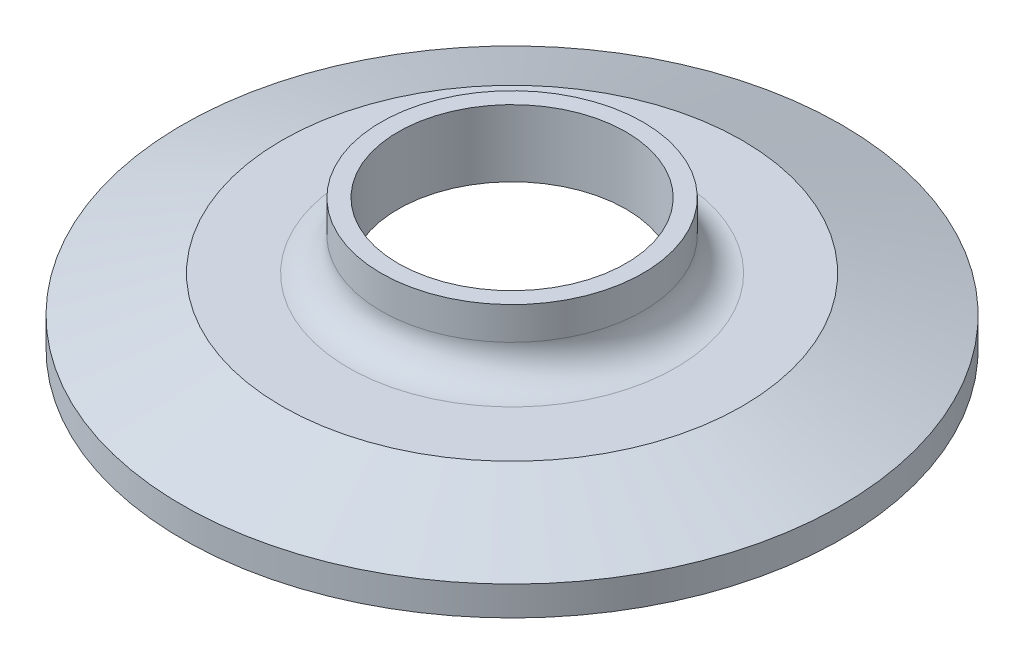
from build123d import *


with BuildPart() as part:
    # Sketch1 → Revolve1 (revolve)
    with BuildSketch(Plane.XY, mode=Mode.PRIVATE) as revolve1_sk:
        with BuildLine():
            Line((-12.7, 12.7), (-12.7, 9.525))
            ThreePointArc((-12.7, 9.525), (-13.62993597, 7.27993597), (-15.875, 6.35))
            Line((-15.875, 6.35), (-22.322742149, 6.35))
            Line((-22.322742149, 6.35), (-31.9532, 2.8448))
            Line((-31.9532, 2.8448), (-31.9532, 0))
            Line((-31.9532, 0), (-30.159172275, 0.002512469))
            ThreePointArc((-30.159172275, 0.002512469), (-29.724577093, 0.133310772), (-29.434366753, 0.482250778))
            Line((-29.434366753, 0.482250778), (-29.267498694, 0.87536729))
            ThreePointArc((-29.267498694, 0.87536729), (-28.1686, 1.602712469), (-27.069701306, 0.87536729))
            Line((-27.069701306, 0.87536729), (-26.902833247, 0.482250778))
            ThreePointArc((-26.902833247, 0.482250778), (-26.612622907, 0.133310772), (-26.178027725, 0.002512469))
            Line((-26.178027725, 0.002512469), (-23.749, 0))
            Line((-23.749, 0), (-11.049, 6.218917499))
            Line((-11.049, 6.218917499), (-11.049, 12.7))
            Line((-11.049, 12.7), (-12.7, 12.7))
        make_face()
    revolve(revolve1_sk.sketch.rotate(Axis((0, 0, 0), (0, 1, 0)), 270), axis=Axis((0, 0, 0), (0, 1, 0)))


solid = part.part
